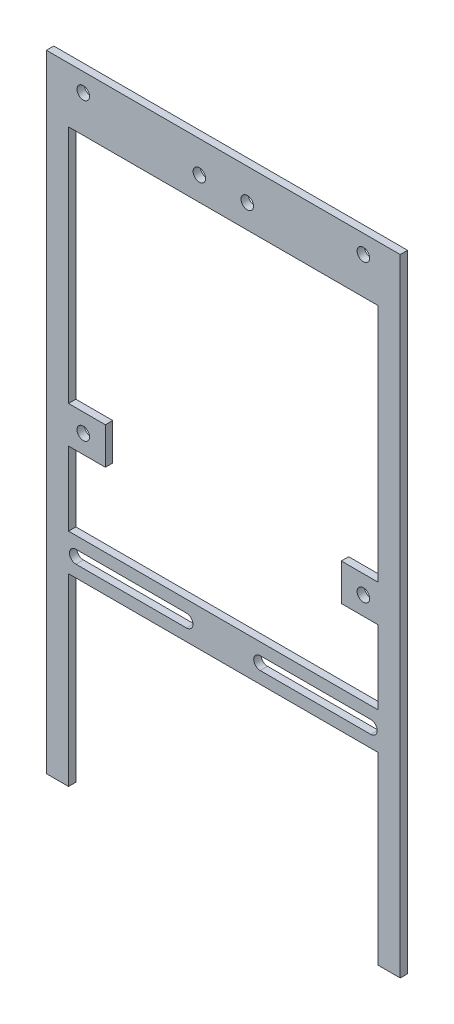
ISO-10303-21;
HEADER;
FILE_DESCRIPTION(('STEP AP214'),'2;1');
FILE_NAME('part.step','',(''),(''),'','','');
FILE_SCHEMA(('AUTOMOTIVE_DESIGN { 1 0 10303 214 1 1 1 1 }'));
ENDSEC;
DATA;
#1=APPLICATION_CONTEXT('core data for automotive mechanical design processes');
#2=APPLICATION_PROTOCOL_DEFINITION('international standard','automotive_design',2000,#1);
#3=PRODUCT_CONTEXT('',#1,'mechanical');
#4=PRODUCT('Part','Part','',(#3));
#5=PRODUCT_RELATED_PRODUCT_CATEGORY('part','',(#4));
#6=PRODUCT_DEFINITION_FORMATION('','',#4);
#7=PRODUCT_DEFINITION_CONTEXT('part definition',#1,'design');
#8=PRODUCT_DEFINITION('design','',#6,#7);
#9=PRODUCT_DEFINITION_SHAPE('','',#8);
#10=(LENGTH_UNIT() NAMED_UNIT(*) SI_UNIT(.MILLI.,.METRE.));
#11=(NAMED_UNIT(*) PLANE_ANGLE_UNIT() SI_UNIT($,.RADIAN.));
#12=(NAMED_UNIT(*) SI_UNIT($,.STERADIAN.) SOLID_ANGLE_UNIT());
#13=UNCERTAINTY_MEASURE_WITH_UNIT(LENGTH_MEASURE(1.E-05),#10,'distance_accuracy_value','');
#14=(GEOMETRIC_REPRESENTATION_CONTEXT(3) GLOBAL_UNCERTAINTY_ASSIGNED_CONTEXT((#13)) GLOBAL_UNIT_ASSIGNED_CONTEXT((#10,
#11,#12)) REPRESENTATION_CONTEXT('',''));
#15=CARTESIAN_POINT('',(0.,0.,0.));
#16=DIRECTION('',(0.,0.,1.));
#17=DIRECTION('',(1.,0.,0.));
#18=AXIS2_PLACEMENT_3D('',#15,#16,#17);
#19=CARTESIAN_POINT('',(0.,0.,2.));
#20=DIRECTION('',(0.,0.,1.));
#21=DIRECTION('',(1.,0.,0.));
#22=AXIS2_PLACEMENT_3D('',#19,#20,#21);
#23=PLANE('',#22);
#24=CARTESIAN_POINT('',(9.99999999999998,-30.,2.));
#25=DIRECTION('',(0.,0.,1.));
#26=DIRECTION('',(1.,0.,0.));
#27=AXIS2_PLACEMENT_3D('',#24,#25,#26);
#28=CIRCLE('',#27,1.75);
#29=CARTESIAN_POINT('',(9.99999999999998,-28.25,2.));
#30=VERTEX_POINT('',#29);
#31=CARTESIAN_POINT('',(9.99999999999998,-31.75,2.));
#32=VERTEX_POINT('',#31);
#33=EDGE_CURVE('E51',#30,#32,#28,.T.);
#34=ORIENTED_EDGE('',*,*,#33,.F.);
#35=DIRECTION('',(-1.,0.,0.));
#36=VECTOR('',#35,1.);
#37=CARTESIAN_POINT('',(9.99999999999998,-28.25,2.));
#38=LINE('',#37,#36);
#39=CARTESIAN_POINT('',(40.,-28.25,2.));
#40=VERTEX_POINT('',#39);
#41=EDGE_CURVE('E229',#40,#30,#38,.T.);
#42=ORIENTED_EDGE('',*,*,#41,.F.);
#43=CARTESIAN_POINT('',(40.,-30.,2.));
#44=DIRECTION('',(0.,0.,1.));
#45=DIRECTION('',(1.,0.,0.));
#46=AXIS2_PLACEMENT_3D('',#43,#44,#45);
#47=CIRCLE('',#46,1.75);
#48=CARTESIAN_POINT('',(40.,-31.75,2.));
#49=VERTEX_POINT('',#48);
#50=EDGE_CURVE('E249',#49,#40,#47,.T.);
#51=ORIENTED_EDGE('',*,*,#50,.F.);
#52=DIRECTION('',(1.,0.,0.));
#53=VECTOR('',#52,1.);
#54=CARTESIAN_POINT('',(9.99999999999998,-31.75,2.));
#55=LINE('',#54,#53);
#56=EDGE_CURVE('E243',#32,#49,#55,.T.);
#57=ORIENTED_EDGE('',*,*,#56,.F.);
#58=EDGE_LOOP('',(#34,#42,#51,#57));
#59=FACE_BOUND('',#58,.T.);
#60=CARTESIAN_POINT('',(-40.,-30.,2.));
#61=DIRECTION('',(0.,0.,1.));
#62=DIRECTION('',(1.,0.,0.));
#63=AXIS2_PLACEMENT_3D('',#60,#61,#62);
#64=CIRCLE('',#63,1.75);
#65=CARTESIAN_POINT('',(-40.,-28.25,2.));
#66=VERTEX_POINT('',#65);
#67=CARTESIAN_POINT('',(-40.,-31.75,2.));
#68=VERTEX_POINT('',#67);
#69=EDGE_CURVE('E265',#66,#68,#64,.T.);
#70=ORIENTED_EDGE('',*,*,#69,.F.);
#71=DIRECTION('',(-1.,0.,0.));
#72=VECTOR('',#71,1.);
#73=CARTESIAN_POINT('',(-40.,-28.25,2.));
#74=LINE('',#73,#72);
#75=CARTESIAN_POINT('',(-10.,-28.25,2.));
#76=VERTEX_POINT('',#75);
#77=EDGE_CURVE('E273',#76,#66,#74,.T.);
#78=ORIENTED_EDGE('',*,*,#77,.F.);
#79=CARTESIAN_POINT('',(-10.,-30.,2.));
#80=DIRECTION('',(0.,0.,1.));
#81=DIRECTION('',(1.,0.,0.));
#82=AXIS2_PLACEMENT_3D('',#79,#80,#81);
#83=CIRCLE('',#82,1.75);
#84=CARTESIAN_POINT('',(-10.,-31.75,2.));
#85=VERTEX_POINT('',#84);
#86=EDGE_CURVE('E270',#85,#76,#83,.T.);
#87=ORIENTED_EDGE('',*,*,#86,.F.);
#88=DIRECTION('',(1.,0.,0.));
#89=VECTOR('',#88,1.);
#90=CARTESIAN_POINT('',(-40.,-31.75,2.));
#91=LINE('',#90,#89);
#92=EDGE_CURVE('E267',#68,#85,#91,.T.);
#93=ORIENTED_EDGE('',*,*,#92,.F.);
#94=EDGE_LOOP('',(#70,#78,#87,#93));
#95=FACE_BOUND('',#94,.T.);
#96=CARTESIAN_POINT('',(-38.,79.9999999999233,2.));
#97=DIRECTION('',(0.,0.,1.));
#98=DIRECTION('',(1.,0.,0.));
#99=AXIS2_PLACEMENT_3D('',#96,#97,#98);
#100=CIRCLE('',#99,1.69999999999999);
#101=CARTESIAN_POINT('',(-36.3,79.9999999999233,2.));
#102=VERTEX_POINT('',#101);
#103=EDGE_CURVE('E429',#102,#102,#100,.T.);
#104=ORIENTED_EDGE('',*,*,#103,.F.);
#105=EDGE_LOOP('',(#104));
#106=FACE_BOUND('',#105,.T.);
#107=CARTESIAN_POINT('',(38.,79.9999999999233,2.));
#108=DIRECTION('',(0.,0.,1.));
#109=DIRECTION('',(1.,0.,0.));
#110=AXIS2_PLACEMENT_3D('',#107,#108,#109);
#111=CIRCLE('',#110,1.69999999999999);
#112=CARTESIAN_POINT('',(39.7,79.9999999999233,2.));
#113=VERTEX_POINT('',#112);
#114=EDGE_CURVE('E435',#113,#113,#111,.T.);
#115=ORIENTED_EDGE('',*,*,#114,.F.);
#116=EDGE_LOOP('',(#115));
#117=FACE_BOUND('',#116,.T.);
#118=CARTESIAN_POINT('',(-38.,-7.66695734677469E-11,2.));
#119=DIRECTION('',(0.,0.,1.));
#120=DIRECTION('',(1.,0.,0.));
#121=AXIS2_PLACEMENT_3D('',#118,#119,#120);
#122=CIRCLE('',#121,1.69999999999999);
#123=CARTESIAN_POINT('',(-36.3,-7.66695734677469E-11,2.));
#124=VERTEX_POINT('',#123);
#125=EDGE_CURVE('E441',#124,#124,#122,.T.);
#126=ORIENTED_EDGE('',*,*,#125,.F.);
#127=EDGE_LOOP('',(#126));
#128=FACE_BOUND('',#127,.T.);
#129=CARTESIAN_POINT('',(38.,-7.66461547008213E-11,2.));
#130=DIRECTION('',(0.,0.,1.));
#131=DIRECTION('',(1.,0.,0.));
#132=AXIS2_PLACEMENT_3D('',#129,#130,#131);
#133=CIRCLE('',#132,1.69999999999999);
#134=CARTESIAN_POINT('',(39.7,-7.66461547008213E-11,2.));
#135=VERTEX_POINT('',#134);
#136=EDGE_CURVE('E447',#135,#135,#133,.T.);
#137=ORIENTED_EDGE('',*,*,#136,.F.);
#138=EDGE_LOOP('',(#137));
#139=FACE_BOUND('',#138,.T.);
#140=CARTESIAN_POINT('',(-6.50000000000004,76.4436386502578,2.));
#141=DIRECTION('',(0.,0.,1.));
#142=DIRECTION('',(1.,0.,0.));
#143=AXIS2_PLACEMENT_3D('',#140,#141,#142);
#144=CIRCLE('',#143,1.69999999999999);
#145=CARTESIAN_POINT('',(-4.80000000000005,76.4436386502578,2.));
#146=VERTEX_POINT('',#145);
#147=EDGE_CURVE('E453',#146,#146,#144,.T.);
#148=ORIENTED_EDGE('',*,*,#147,.F.);
#149=EDGE_LOOP('',(#148));
#150=FACE_BOUND('',#149,.T.);
#151=CARTESIAN_POINT('',(6.49999999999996,76.4436386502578,2.));
#152=DIRECTION('',(0.,0.,1.));
#153=DIRECTION('',(1.,0.,0.));
#154=AXIS2_PLACEMENT_3D('',#151,#152,#153);
#155=CIRCLE('',#154,1.69999999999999);
#156=CARTESIAN_POINT('',(8.19999999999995,76.4436386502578,2.));
#157=VERTEX_POINT('',#156);
#158=EDGE_CURVE('E459',#157,#157,#155,.T.);
#159=ORIENTED_EDGE('',*,*,#158,.F.);
#160=EDGE_LOOP('',(#159));
#161=FACE_BOUND('',#160,.T.);
#162=DIRECTION('',(0.,-1.,0.));
#163=VECTOR('',#162,1.);
#164=CARTESIAN_POINT('',(32.,0.,2.));
#165=LINE('',#164,#163);
#166=CARTESIAN_POINT('',(32.,4.99999999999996,2.));
#167=VERTEX_POINT('',#166);
#168=CARTESIAN_POINT('',(32.,-5.00000000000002,2.));
#169=VERTEX_POINT('',#168);
#170=EDGE_CURVE('E368',#167,#169,#165,.T.);
#171=ORIENTED_EDGE('',*,*,#170,.T.);
#172=DIRECTION('',(1.,0.,0.));
#173=VECTOR('',#172,1.);
#174=CARTESIAN_POINT('',(0.,-4.99999999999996,2.));
#175=LINE('',#174,#173);
#176=CARTESIAN_POINT('',(42.,-5.00000000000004,2.));
#177=VERTEX_POINT('',#176);
#178=EDGE_CURVE('E365',#169,#177,#175,.T.);
#179=ORIENTED_EDGE('',*,*,#178,.T.);
#180=DIRECTION('',(0.,-1.,0.));
#181=VECTOR('',#180,1.);
#182=CARTESIAN_POINT('',(42.,0.,2.));
#183=LINE('',#182,#181);
#184=CARTESIAN_POINT('',(42.,-25.,2.));
#185=VERTEX_POINT('',#184);
#186=EDGE_CURVE('E398',#177,#185,#183,.T.);
#187=ORIENTED_EDGE('',*,*,#186,.T.);
#188=DIRECTION('',(1.,0.,0.));
#189=VECTOR('',#188,1.);
#190=CARTESIAN_POINT('',(0.,-25.,2.));
#191=LINE('',#190,#189);
#192=CARTESIAN_POINT('',(-42.,-25.,2.));
#193=VERTEX_POINT('',#192);
#194=EDGE_CURVE('E395',#193,#185,#191,.T.);
#195=ORIENTED_EDGE('',*,*,#194,.F.);
#196=DIRECTION('',(0.,-1.,0.));
#197=VECTOR('',#196,1.);
#198=CARTESIAN_POINT('',(-42.,0.,2.));
#199=LINE('',#198,#197);
#200=CARTESIAN_POINT('',(-42.,-5.00000000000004,2.));
#201=VERTEX_POINT('',#200);
#202=EDGE_CURVE('E392',#201,#193,#199,.T.);
#203=ORIENTED_EDGE('',*,*,#202,.F.);
#204=DIRECTION('',(1.,0.,0.));
#205=VECTOR('',#204,1.);
#206=CARTESIAN_POINT('',(0.,-4.99999999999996,2.));
#207=LINE('',#206,#205);
#208=CARTESIAN_POINT('',(-32.,-5.00000000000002,2.));
#209=VERTEX_POINT('',#208);
#210=EDGE_CURVE('E389',#201,#209,#207,.T.);
#211=ORIENTED_EDGE('',*,*,#210,.T.);
#212=DIRECTION('',(0.,-1.,0.));
#213=VECTOR('',#212,1.);
#214=CARTESIAN_POINT('',(-32.,0.,2.));
#215=LINE('',#214,#213);
#216=CARTESIAN_POINT('',(-32.,4.99999999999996,2.));
#217=VERTEX_POINT('',#216);
#218=EDGE_CURVE('E386',#217,#209,#215,.T.);
#219=ORIENTED_EDGE('',*,*,#218,.F.);
#220=DIRECTION('',(1.,0.,0.));
#221=VECTOR('',#220,1.);
#222=CARTESIAN_POINT('',(0.,4.99999999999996,2.));
#223=LINE('',#222,#221);
#224=CARTESIAN_POINT('',(-42.,4.99999999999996,2.));
#225=VERTEX_POINT('',#224);
#226=EDGE_CURVE('E383',#225,#217,#223,.T.);
#227=ORIENTED_EDGE('',*,*,#226,.F.);
#228=DIRECTION('',(0.,-1.,0.));
#229=VECTOR('',#228,1.);
#230=CARTESIAN_POINT('',(-42.,0.,2.));
#231=LINE('',#230,#229);
#232=CARTESIAN_POINT('',(-42.,70.,2.));
#233=VERTEX_POINT('',#232);
#234=EDGE_CURVE('E380',#233,#225,#231,.T.);
#235=ORIENTED_EDGE('',*,*,#234,.F.);
#236=DIRECTION('',(1.,0.,0.));
#237=VECTOR('',#236,1.);
#238=CARTESIAN_POINT('',(0.,70.,2.));
#239=LINE('',#238,#237);
#240=CARTESIAN_POINT('',(42.,70.,2.));
#241=VERTEX_POINT('',#240);
#242=EDGE_CURVE('E377',#233,#241,#239,.T.);
#243=ORIENTED_EDGE('',*,*,#242,.T.);
#244=DIRECTION('',(0.,-1.,0.));
#245=VECTOR('',#244,1.);
#246=CARTESIAN_POINT('',(42.,0.,2.));
#247=LINE('',#246,#245);
#248=CARTESIAN_POINT('',(42.,4.99999999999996,2.));
#249=VERTEX_POINT('',#248);
#250=EDGE_CURVE('E374',#241,#249,#247,.T.);
#251=ORIENTED_EDGE('',*,*,#250,.T.);
#252=DIRECTION('',(1.,0.,0.));
#253=VECTOR('',#252,1.);
#254=CARTESIAN_POINT('',(0.,4.99999999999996,2.));
#255=LINE('',#254,#253);
#256=EDGE_CURVE('E371',#167,#249,#255,.T.);
#257=ORIENTED_EDGE('',*,*,#256,.F.);
#258=EDGE_LOOP('',(#171,#179,#187,#195,#203,#211,#219,#227,#235,#243,#251,#257));
#259=FACE_BOUND('',#258,.T.);
#260=DIRECTION('',(1.,0.,0.));
#261=VECTOR('',#260,1.);
#262=CARTESIAN_POINT('',(0.,-35.,2.));
#263=LINE('',#262,#261);
#264=CARTESIAN_POINT('',(-42.,-35.,2.));
#265=VERTEX_POINT('',#264);
#266=CARTESIAN_POINT('',(42.,-35.,2.));
#267=VERTEX_POINT('',#266);
#268=EDGE_CURVE('E320',#265,#267,#263,.T.);
#269=ORIENTED_EDGE('',*,*,#268,.T.);
#270=DIRECTION('',(0.,-1.,0.));
#271=VECTOR('',#270,1.);
#272=CARTESIAN_POINT('',(42.,0.,2.));
#273=LINE('',#272,#271);
#274=CARTESIAN_POINT('',(42.,-85.,2.));
#275=VERTEX_POINT('',#274);
#276=EDGE_CURVE('E317',#267,#275,#273,.T.);
#277=ORIENTED_EDGE('',*,*,#276,.T.);
#278=DIRECTION('',(1.,0.,0.));
#279=VECTOR('',#278,1.);
#280=CARTESIAN_POINT('',(-47.,-85.,2.));
#281=LINE('',#280,#279);
#282=CARTESIAN_POINT('',(48.,-85.,2.));
#283=VERTEX_POINT('',#282);
#284=EDGE_CURVE('E43',#275,#283,#281,.T.);
#285=ORIENTED_EDGE('',*,*,#284,.T.);
#286=DIRECTION('',(0.,-1.,0.));
#287=VECTOR('',#286,1.);
#288=CARTESIAN_POINT('',(48.,85.,2.));
#289=LINE('',#288,#287);
#290=CARTESIAN_POINT('',(48.,85.,2.));
#291=VERTEX_POINT('',#290);
#292=EDGE_CURVE('E309',#291,#283,#289,.T.);
#293=ORIENTED_EDGE('',*,*,#292,.F.);
#294=DIRECTION('',(-1.,0.,0.));
#295=VECTOR('',#294,1.);
#296=CARTESIAN_POINT('',(-47.,85.,2.));
#297=LINE('',#296,#295);
#298=CARTESIAN_POINT('',(-48.,85.,2.));
#299=VERTEX_POINT('',#298);
#300=EDGE_CURVE('E466',#291,#299,#297,.T.);
#301=ORIENTED_EDGE('',*,*,#300,.T.);
#302=DIRECTION('',(0.,1.,0.));
#303=VECTOR('',#302,1.);
#304=CARTESIAN_POINT('',(-48.,-85.,2.));
#305=LINE('',#304,#303);
#306=CARTESIAN_POINT('',(-48.,-85.,2.));
#307=VERTEX_POINT('',#306);
#308=EDGE_CURVE('E297',#307,#299,#305,.T.);
#309=ORIENTED_EDGE('',*,*,#308,.F.);
#310=CARTESIAN_POINT('',(-42.,-85.,2.));
#311=VERTEX_POINT('',#310);
#312=EDGE_CURVE('E11',#307,#311,#281,.T.);
#313=ORIENTED_EDGE('',*,*,#312,.T.);
#314=DIRECTION('',(0.,-1.,0.));
#315=VECTOR('',#314,1.);
#316=CARTESIAN_POINT('',(-42.,0.,2.));
#317=LINE('',#316,#315);
#318=EDGE_CURVE('E323',#265,#311,#317,.T.);
#319=ORIENTED_EDGE('',*,*,#318,.F.);
#320=EDGE_LOOP('',(#269,#277,#285,#293,#301,#309,#313,#319));
#321=FACE_BOUND('',#320,.T.);
#322=ADVANCED_FACE('F34',(#59,#95,#106,#117,#128,#139,#150,#161,#259,#321),#23,.T.);
#323=CARTESIAN_POINT('',(0.,0.,0.));
#324=DIRECTION('',(0.,0.,1.));
#325=DIRECTION('',(1.,0.,0.));
#326=AXIS2_PLACEMENT_3D('',#323,#324,#325);
#327=PLANE('',#326);
#328=DIRECTION('',(1.,0.,0.));
#329=VECTOR('',#328,1.);
#330=CARTESIAN_POINT('',(9.99999999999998,-28.25,0.));
#331=LINE('',#330,#329);
#332=CARTESIAN_POINT('',(9.99999999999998,-28.25,0.));
#333=VERTEX_POINT('',#332);
#334=CARTESIAN_POINT('',(40.,-28.25,0.));
#335=VERTEX_POINT('',#334);
#336=EDGE_CURVE('E241',#333,#335,#331,.T.);
#337=ORIENTED_EDGE('',*,*,#336,.F.);
#338=CARTESIAN_POINT('',(9.99999999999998,-30.,0.));
#339=DIRECTION('',(0.,0.,1.));
#340=DIRECTION('',(1.,0.,0.));
#341=AXIS2_PLACEMENT_3D('',#338,#339,#340);
#342=CIRCLE('',#341,1.75);
#343=CARTESIAN_POINT('',(9.99999999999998,-31.75,0.));
#344=VERTEX_POINT('',#343);
#345=EDGE_CURVE('E223',#344,#333,#342,.F.);
#346=ORIENTED_EDGE('',*,*,#345,.F.);
#347=DIRECTION('',(-1.,0.,0.));
#348=VECTOR('',#347,1.);
#349=CARTESIAN_POINT('',(9.99999999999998,-31.75,0.));
#350=LINE('',#349,#348);
#351=CARTESIAN_POINT('',(40.,-31.75,0.));
#352=VERTEX_POINT('',#351);
#353=EDGE_CURVE('E232',#352,#344,#350,.T.);
#354=ORIENTED_EDGE('',*,*,#353,.F.);
#355=CARTESIAN_POINT('',(40.,-30.,0.));
#356=DIRECTION('',(0.,0.,1.));
#357=DIRECTION('',(1.,0.,0.));
#358=AXIS2_PLACEMENT_3D('',#355,#356,#357);
#359=CIRCLE('',#358,1.75);
#360=EDGE_CURVE('E59',#335,#352,#359,.F.);
#361=ORIENTED_EDGE('',*,*,#360,.F.);
#362=EDGE_LOOP('',(#337,#346,#354,#361));
#363=FACE_BOUND('',#362,.T.);
#364=DIRECTION('',(1.,0.,0.));
#365=VECTOR('',#364,1.);
#366=CARTESIAN_POINT('',(-40.,-28.25,0.));
#367=LINE('',#366,#365);
#368=CARTESIAN_POINT('',(-40.,-28.25,0.));
#369=VERTEX_POINT('',#368);
#370=CARTESIAN_POINT('',(-10.,-28.25,0.));
#371=VERTEX_POINT('',#370);
#372=EDGE_CURVE('E259',#369,#371,#367,.T.);
#373=ORIENTED_EDGE('',*,*,#372,.F.);
#374=CARTESIAN_POINT('',(-40.,-30.,0.));
#375=DIRECTION('',(0.,0.,1.));
#376=DIRECTION('',(1.,0.,0.));
#377=AXIS2_PLACEMENT_3D('',#374,#375,#376);
#378=CIRCLE('',#377,1.75);
#379=CARTESIAN_POINT('',(-40.,-31.75,0.));
#380=VERTEX_POINT('',#379);
#381=EDGE_CURVE('E262',#380,#369,#378,.F.);
#382=ORIENTED_EDGE('',*,*,#381,.F.);
#383=DIRECTION('',(-1.,0.,0.));
#384=VECTOR('',#383,1.);
#385=CARTESIAN_POINT('',(-40.,-31.75,0.));
#386=LINE('',#385,#384);
#387=CARTESIAN_POINT('',(-10.,-31.75,0.));
#388=VERTEX_POINT('',#387);
#389=EDGE_CURVE('E279',#388,#380,#386,.T.);
#390=ORIENTED_EDGE('',*,*,#389,.F.);
#391=CARTESIAN_POINT('',(-10.,-30.,0.));
#392=DIRECTION('',(0.,0.,1.));
#393=DIRECTION('',(1.,0.,0.));
#394=AXIS2_PLACEMENT_3D('',#391,#392,#393);
#395=CIRCLE('',#394,1.75);
#396=EDGE_CURVE('E235',#371,#388,#395,.F.);
#397=ORIENTED_EDGE('',*,*,#396,.F.);
#398=EDGE_LOOP('',(#373,#382,#390,#397));
#399=FACE_BOUND('',#398,.T.);
#400=DIRECTION('',(-1.,0.,0.));
#401=VECTOR('',#400,1.);
#402=CARTESIAN_POINT('',(0.,-4.99999999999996,0.));
#403=LINE('',#402,#401);
#404=CARTESIAN_POINT('',(42.,-5.00000000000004,0.));
#405=VERTEX_POINT('',#404);
#406=CARTESIAN_POINT('',(32.,-5.00000000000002,0.));
#407=VERTEX_POINT('',#406);
#408=EDGE_CURVE('E362',#405,#407,#403,.T.);
#409=ORIENTED_EDGE('',*,*,#408,.T.);
#410=DIRECTION('',(0.,1.,0.));
#411=VECTOR('',#410,1.);
#412=CARTESIAN_POINT('',(32.,0.,0.));
#413=LINE('',#412,#411);
#414=CARTESIAN_POINT('',(32.,4.99999999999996,0.));
#415=VERTEX_POINT('',#414);
#416=EDGE_CURVE('E404',#407,#415,#413,.T.);
#417=ORIENTED_EDGE('',*,*,#416,.T.);
#418=DIRECTION('',(-1.,0.,0.));
#419=VECTOR('',#418,1.);
#420=CARTESIAN_POINT('',(0.,4.99999999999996,0.));
#421=LINE('',#420,#419);
#422=CARTESIAN_POINT('',(42.,4.99999999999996,0.));
#423=VERTEX_POINT('',#422);
#424=EDGE_CURVE('E337',#423,#415,#421,.T.);
#425=ORIENTED_EDGE('',*,*,#424,.F.);
#426=DIRECTION('',(0.,1.,0.));
#427=VECTOR('',#426,1.);
#428=CARTESIAN_POINT('',(42.,0.,0.));
#429=LINE('',#428,#427);
#430=CARTESIAN_POINT('',(42.,70.,0.));
#431=VERTEX_POINT('',#430);
#432=EDGE_CURVE('E340',#423,#431,#429,.T.);
#433=ORIENTED_EDGE('',*,*,#432,.T.);
#434=DIRECTION('',(-1.,0.,0.));
#435=VECTOR('',#434,1.);
#436=CARTESIAN_POINT('',(0.,70.,0.));
#437=LINE('',#436,#435);
#438=CARTESIAN_POINT('',(-42.,70.,0.));
#439=VERTEX_POINT('',#438);
#440=EDGE_CURVE('E343',#431,#439,#437,.T.);
#441=ORIENTED_EDGE('',*,*,#440,.T.);
#442=DIRECTION('',(0.,1.,0.));
#443=VECTOR('',#442,1.);
#444=CARTESIAN_POINT('',(-42.,0.,0.));
#445=LINE('',#444,#443);
#446=CARTESIAN_POINT('',(-42.,4.99999999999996,0.));
#447=VERTEX_POINT('',#446);
#448=EDGE_CURVE('E346',#447,#439,#445,.T.);
#449=ORIENTED_EDGE('',*,*,#448,.F.);
#450=DIRECTION('',(-1.,0.,0.));
#451=VECTOR('',#450,1.);
#452=CARTESIAN_POINT('',(0.,4.99999999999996,0.));
#453=LINE('',#452,#451);
#454=CARTESIAN_POINT('',(-32.,4.99999999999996,0.));
#455=VERTEX_POINT('',#454);
#456=EDGE_CURVE('E348',#455,#447,#453,.T.);
#457=ORIENTED_EDGE('',*,*,#456,.F.);
#458=DIRECTION('',(0.,1.,0.));
#459=VECTOR('',#458,1.);
#460=CARTESIAN_POINT('',(-32.,0.,0.));
#461=LINE('',#460,#459);
#462=CARTESIAN_POINT('',(-32.,-5.00000000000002,0.));
#463=VERTEX_POINT('',#462);
#464=EDGE_CURVE('E350',#463,#455,#461,.T.);
#465=ORIENTED_EDGE('',*,*,#464,.F.);
#466=DIRECTION('',(-1.,0.,0.));
#467=VECTOR('',#466,1.);
#468=CARTESIAN_POINT('',(0.,-4.99999999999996,0.));
#469=LINE('',#468,#467);
#470=CARTESIAN_POINT('',(-42.,-5.00000000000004,0.));
#471=VERTEX_POINT('',#470);
#472=EDGE_CURVE('E352',#463,#471,#469,.T.);
#473=ORIENTED_EDGE('',*,*,#472,.T.);
#474=DIRECTION('',(0.,1.,0.));
#475=VECTOR('',#474,1.);
#476=CARTESIAN_POINT('',(-42.,0.,0.));
#477=LINE('',#476,#475);
#478=CARTESIAN_POINT('',(-42.,-25.,0.));
#479=VERTEX_POINT('',#478);
#480=EDGE_CURVE('E355',#479,#471,#477,.T.);
#481=ORIENTED_EDGE('',*,*,#480,.F.);
#482=DIRECTION('',(-1.,0.,0.));
#483=VECTOR('',#482,1.);
#484=CARTESIAN_POINT('',(0.,-25.,0.));
#485=LINE('',#484,#483);
#486=CARTESIAN_POINT('',(42.,-25.,0.));
#487=VERTEX_POINT('',#486);
#488=EDGE_CURVE('E357',#487,#479,#485,.T.);
#489=ORIENTED_EDGE('',*,*,#488,.F.);
#490=DIRECTION('',(0.,1.,0.));
#491=VECTOR('',#490,1.);
#492=CARTESIAN_POINT('',(42.,0.,0.));
#493=LINE('',#492,#491);
#494=EDGE_CURVE('E359',#487,#405,#493,.T.);
#495=ORIENTED_EDGE('',*,*,#494,.T.);
#496=EDGE_LOOP('',(#409,#417,#425,#433,#441,#449,#457,#465,#473,#481,#489,#495));
#497=FACE_BOUND('',#496,.T.);
#498=CARTESIAN_POINT('',(-38.,79.9999999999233,0.));
#499=DIRECTION('',(0.,0.,1.));
#500=DIRECTION('',(1.,0.,0.));
#501=AXIS2_PLACEMENT_3D('',#498,#499,#500);
#502=CIRCLE('',#501,1.7);
#503=CARTESIAN_POINT('',(-36.3,79.9999999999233,0.));
#504=VERTEX_POINT('',#503);
#505=EDGE_CURVE('E432',#504,#504,#502,.T.);
#506=ORIENTED_EDGE('',*,*,#505,.T.);
#507=EDGE_LOOP('',(#506));
#508=FACE_BOUND('',#507,.T.);
#509=CARTESIAN_POINT('',(38.,79.9999999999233,0.));
#510=DIRECTION('',(0.,0.,1.));
#511=DIRECTION('',(1.,0.,0.));
#512=AXIS2_PLACEMENT_3D('',#509,#510,#511);
#513=CIRCLE('',#512,1.7);
#514=CARTESIAN_POINT('',(39.7,79.9999999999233,0.));
#515=VERTEX_POINT('',#514);
#516=EDGE_CURVE('E438',#515,#515,#513,.T.);
#517=ORIENTED_EDGE('',*,*,#516,.T.);
#518=EDGE_LOOP('',(#517));
#519=FACE_BOUND('',#518,.T.);
#520=CARTESIAN_POINT('',(-38.,-7.66695734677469E-11,0.));
#521=DIRECTION('',(0.,0.,1.));
#522=DIRECTION('',(1.,0.,0.));
#523=AXIS2_PLACEMENT_3D('',#520,#521,#522);
#524=CIRCLE('',#523,1.7);
#525=CARTESIAN_POINT('',(-36.3,-7.66695734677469E-11,0.));
#526=VERTEX_POINT('',#525);
#527=EDGE_CURVE('E444',#526,#526,#524,.T.);
#528=ORIENTED_EDGE('',*,*,#527,.T.);
#529=EDGE_LOOP('',(#528));
#530=FACE_BOUND('',#529,.T.);
#531=CARTESIAN_POINT('',(38.,-7.66461547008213E-11,0.));
#532=DIRECTION('',(0.,0.,1.));
#533=DIRECTION('',(1.,0.,0.));
#534=AXIS2_PLACEMENT_3D('',#531,#532,#533);
#535=CIRCLE('',#534,1.7);
#536=CARTESIAN_POINT('',(39.7,-7.66461547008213E-11,0.));
#537=VERTEX_POINT('',#536);
#538=EDGE_CURVE('E450',#537,#537,#535,.T.);
#539=ORIENTED_EDGE('',*,*,#538,.T.);
#540=EDGE_LOOP('',(#539));
#541=FACE_BOUND('',#540,.T.);
#542=CARTESIAN_POINT('',(-6.50000000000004,76.4436386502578,0.));
#543=DIRECTION('',(0.,0.,1.));
#544=DIRECTION('',(1.,0.,0.));
#545=AXIS2_PLACEMENT_3D('',#542,#543,#544);
#546=CIRCLE('',#545,1.7);
#547=CARTESIAN_POINT('',(-4.80000000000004,76.4436386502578,0.));
#548=VERTEX_POINT('',#547);
#549=EDGE_CURVE('E456',#548,#548,#546,.T.);
#550=ORIENTED_EDGE('',*,*,#549,.T.);
#551=EDGE_LOOP('',(#550));
#552=FACE_BOUND('',#551,.T.);
#553=CARTESIAN_POINT('',(6.49999999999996,76.4436386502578,0.));
#554=DIRECTION('',(0.,0.,1.));
#555=DIRECTION('',(1.,0.,0.));
#556=AXIS2_PLACEMENT_3D('',#553,#554,#555);
#557=CIRCLE('',#556,1.7);
#558=CARTESIAN_POINT('',(8.19999999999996,76.4436386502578,0.));
#559=VERTEX_POINT('',#558);
#560=EDGE_CURVE('E462',#559,#559,#557,.T.);
#561=ORIENTED_EDGE('',*,*,#560,.T.);
#562=EDGE_LOOP('',(#561));
#563=FACE_BOUND('',#562,.T.);
#564=DIRECTION('',(0.,1.,0.));
#565=VECTOR('',#564,1.);
#566=CARTESIAN_POINT('',(42.,0.,0.));
#567=LINE('',#566,#565);
#568=CARTESIAN_POINT('',(42.,-85.,0.));
#569=VERTEX_POINT('',#568);
#570=CARTESIAN_POINT('',(42.,-35.,0.));
#571=VERTEX_POINT('',#570);
#572=EDGE_CURVE('E314',#569,#571,#567,.T.);
#573=ORIENTED_EDGE('',*,*,#572,.T.);
#574=DIRECTION('',(-1.,0.,0.));
#575=VECTOR('',#574,1.);
#576=CARTESIAN_POINT('',(0.,-35.,0.));
#577=LINE('',#576,#575);
#578=CARTESIAN_POINT('',(-42.,-35.,0.));
#579=VERTEX_POINT('',#578);
#580=EDGE_CURVE('E328',#571,#579,#577,.T.);
#581=ORIENTED_EDGE('',*,*,#580,.T.);
#582=DIRECTION('',(0.,1.,0.));
#583=VECTOR('',#582,1.);
#584=CARTESIAN_POINT('',(-42.,0.,0.));
#585=LINE('',#584,#583);
#586=CARTESIAN_POINT('',(-42.,-85.,0.));
#587=VERTEX_POINT('',#586);
#588=EDGE_CURVE('E312',#587,#579,#585,.T.);
#589=ORIENTED_EDGE('',*,*,#588,.F.);
#590=DIRECTION('',(1.,0.,0.));
#591=VECTOR('',#590,1.);
#592=CARTESIAN_POINT('',(-47.,-85.,0.));
#593=LINE('',#592,#591);
#594=CARTESIAN_POINT('',(-48.,-85.,0.));
#595=VERTEX_POINT('',#594);
#596=EDGE_CURVE('E38',#595,#587,#593,.T.);
#597=ORIENTED_EDGE('',*,*,#596,.F.);
#598=DIRECTION('',(0.,-1.,0.));
#599=VECTOR('',#598,1.);
#600=CARTESIAN_POINT('',(-48.,85.,0.));
#601=LINE('',#600,#599);
#602=CARTESIAN_POINT('',(-48.,85.,0.));
#603=VERTEX_POINT('',#602);
#604=EDGE_CURVE('E291',#603,#595,#601,.T.);
#605=ORIENTED_EDGE('',*,*,#604,.F.);
#606=DIRECTION('',(-1.,0.,0.));
#607=VECTOR('',#606,1.);
#608=CARTESIAN_POINT('',(-47.,85.,0.));
#609=LINE('',#608,#607);
#610=CARTESIAN_POINT('',(48.,85.,0.));
#611=VERTEX_POINT('',#610);
#612=EDGE_CURVE('E465',#611,#603,#609,.T.);
#613=ORIENTED_EDGE('',*,*,#612,.F.);
#614=DIRECTION('',(0.,1.,0.));
#615=VECTOR('',#614,1.);
#616=CARTESIAN_POINT('',(48.,-85.,0.));
#617=LINE('',#616,#615);
#618=CARTESIAN_POINT('',(48.,-85.,0.));
#619=VERTEX_POINT('',#618);
#620=EDGE_CURVE('E303',#619,#611,#617,.T.);
#621=ORIENTED_EDGE('',*,*,#620,.F.);
#622=EDGE_CURVE('E467',#569,#619,#593,.T.);
#623=ORIENTED_EDGE('',*,*,#622,.F.);
#624=EDGE_LOOP('',(#573,#581,#589,#597,#605,#613,#621,#623));
#625=FACE_BOUND('',#624,.T.);
#626=ADVANCED_FACE('F238',(#363,#399,#497,#508,#519,#530,#541,#552,#563,#625),#327,.F.);
#627=CARTESIAN_POINT('',(-47.,-85.,2.));
#628=DIRECTION('',(0.,1.,0.));
#629=DIRECTION('',(0.,0.,1.));
#630=AXIS2_PLACEMENT_3D('',#627,#628,#629);
#631=PLANE('',#630);
#632=DIRECTION('',(0.,0.,1.));
#633=VECTOR('',#632,1.);
#634=CARTESIAN_POINT('',(42.,-85.,-0.00100000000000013));
#635=LINE('',#634,#633);
#636=EDGE_CURVE('E326',#569,#275,#635,.T.);
#637=ORIENTED_EDGE('',*,*,#636,.F.);
#638=ORIENTED_EDGE('',*,*,#622,.T.);
#639=DIRECTION('',(0.,0.,-1.));
#640=VECTOR('',#639,1.);
#641=CARTESIAN_POINT('',(48.,-85.,2.));
#642=LINE('',#641,#640);
#643=EDGE_CURVE('E300',#283,#619,#642,.T.);
#644=ORIENTED_EDGE('',*,*,#643,.F.);
#645=ORIENTED_EDGE('',*,*,#284,.F.);
#646=EDGE_LOOP('',(#637,#638,#644,#645));
#647=FACE_BOUND('',#646,.T.);
#648=ADVANCED_FACE('F492',(#647),#631,.F.);
#649=CARTESIAN_POINT('',(-47.,85.,2.));
#650=DIRECTION('',(0.,-1.,0.));
#651=DIRECTION('',(0.,0.,-1.));
#652=AXIS2_PLACEMENT_3D('',#649,#650,#651);
#653=PLANE('',#652);
#654=ORIENTED_EDGE('',*,*,#612,.T.);
#655=DIRECTION('',(0.,0.,-1.));
#656=VECTOR('',#655,1.);
#657=CARTESIAN_POINT('',(-48.,85.,2.));
#658=LINE('',#657,#656);
#659=EDGE_CURVE('E288',#299,#603,#658,.T.);
#660=ORIENTED_EDGE('',*,*,#659,.F.);
#661=ORIENTED_EDGE('',*,*,#300,.F.);
#662=DIRECTION('',(0.,0.,1.));
#663=VECTOR('',#662,1.);
#664=CARTESIAN_POINT('',(48.,85.,0.));
#665=LINE('',#664,#663);
#666=EDGE_CURVE('E306',#611,#291,#665,.T.);
#667=ORIENTED_EDGE('',*,*,#666,.F.);
#668=EDGE_LOOP('',(#654,#660,#661,#667));
#669=FACE_BOUND('',#668,.T.);
#670=ADVANCED_FACE('F36',(#669),#653,.F.);
#671=ORIENTED_EDGE('',*,*,#596,.T.);
#672=DIRECTION('',(0.,0.,1.));
#673=VECTOR('',#672,1.);
#674=CARTESIAN_POINT('',(-42.,-85.,-0.00100000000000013));
#675=LINE('',#674,#673);
#676=EDGE_CURVE('E329',#587,#311,#675,.T.);
#677=ORIENTED_EDGE('',*,*,#676,.T.);
#678=ORIENTED_EDGE('',*,*,#312,.F.);
#679=DIRECTION('',(0.,0.,1.));
#680=VECTOR('',#679,1.);
#681=CARTESIAN_POINT('',(-48.,-85.,0.));
#682=LINE('',#681,#680);
#683=EDGE_CURVE('E294',#595,#307,#682,.T.);
#684=ORIENTED_EDGE('',*,*,#683,.F.);
#685=EDGE_LOOP('',(#671,#677,#678,#684));
#686=FACE_BOUND('',#685,.T.);
#687=ADVANCED_FACE('F480',(#686),#631,.F.);
#688=CARTESIAN_POINT('',(6.49999999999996,76.4436386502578,2.));
#689=DIRECTION('',(0.,0.,1.));
#690=DIRECTION('',(1.,0.,0.));
#691=AXIS2_PLACEMENT_3D('',#688,#689,#690);
#692=CYLINDRICAL_SURFACE('',#691,1.69999999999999);
#693=ORIENTED_EDGE('',*,*,#560,.F.);
#694=EDGE_LOOP('',(#693));
#695=FACE_BOUND('',#694,.T.);
#696=ORIENTED_EDGE('',*,*,#158,.T.);
#697=EDGE_LOOP('',(#696));
#698=FACE_BOUND('',#697,.T.);
#699=ADVANCED_FACE('F522',(#695,#698),#692,.F.);
#700=CARTESIAN_POINT('',(-6.50000000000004,76.4436386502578,2.));
#701=DIRECTION('',(0.,0.,1.));
#702=DIRECTION('',(1.,0.,0.));
#703=AXIS2_PLACEMENT_3D('',#700,#701,#702);
#704=CYLINDRICAL_SURFACE('',#703,1.69999999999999);
#705=ORIENTED_EDGE('',*,*,#549,.F.);
#706=EDGE_LOOP('',(#705));
#707=FACE_BOUND('',#706,.T.);
#708=ORIENTED_EDGE('',*,*,#147,.T.);
#709=EDGE_LOOP('',(#708));
#710=FACE_BOUND('',#709,.T.);
#711=ADVANCED_FACE('F529',(#707,#710),#704,.F.);
#712=CARTESIAN_POINT('',(38.,-7.66461547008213E-11,2.));
#713=DIRECTION('',(0.,0.,1.));
#714=DIRECTION('',(1.,0.,0.));
#715=AXIS2_PLACEMENT_3D('',#712,#713,#714);
#716=CYLINDRICAL_SURFACE('',#715,1.69999999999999);
#717=ORIENTED_EDGE('',*,*,#538,.F.);
#718=EDGE_LOOP('',(#717));
#719=FACE_BOUND('',#718,.T.);
#720=ORIENTED_EDGE('',*,*,#136,.T.);
#721=EDGE_LOOP('',(#720));
#722=FACE_BOUND('',#721,.T.);
#723=ADVANCED_FACE('F813',(#719,#722),#716,.F.);
#724=CARTESIAN_POINT('',(-38.,-7.66695734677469E-11,2.));
#725=DIRECTION('',(0.,0.,1.));
#726=DIRECTION('',(1.,0.,0.));
#727=AXIS2_PLACEMENT_3D('',#724,#725,#726);
#728=CYLINDRICAL_SURFACE('',#727,1.69999999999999);
#729=ORIENTED_EDGE('',*,*,#527,.F.);
#730=EDGE_LOOP('',(#729));
#731=FACE_BOUND('',#730,.T.);
#732=ORIENTED_EDGE('',*,*,#125,.T.);
#733=EDGE_LOOP('',(#732));
#734=FACE_BOUND('',#733,.T.);
#735=ADVANCED_FACE('F803',(#731,#734),#728,.F.);
#736=CARTESIAN_POINT('',(38.,79.9999999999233,2.));
#737=DIRECTION('',(0.,0.,1.));
#738=DIRECTION('',(1.,0.,0.));
#739=AXIS2_PLACEMENT_3D('',#736,#737,#738);
#740=CYLINDRICAL_SURFACE('',#739,1.69999999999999);
#741=ORIENTED_EDGE('',*,*,#516,.F.);
#742=EDGE_LOOP('',(#741));
#743=FACE_BOUND('',#742,.T.);
#744=ORIENTED_EDGE('',*,*,#114,.T.);
#745=EDGE_LOOP('',(#744));
#746=FACE_BOUND('',#745,.T.);
#747=ADVANCED_FACE('F792',(#743,#746),#740,.F.);
#748=CARTESIAN_POINT('',(-38.,79.9999999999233,2.));
#749=DIRECTION('',(0.,0.,1.));
#750=DIRECTION('',(1.,0.,0.));
#751=AXIS2_PLACEMENT_3D('',#748,#749,#750);
#752=CYLINDRICAL_SURFACE('',#751,1.69999999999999);
#753=ORIENTED_EDGE('',*,*,#505,.F.);
#754=EDGE_LOOP('',(#753));
#755=FACE_BOUND('',#754,.T.);
#756=ORIENTED_EDGE('',*,*,#103,.T.);
#757=EDGE_LOOP('',(#756));
#758=FACE_BOUND('',#757,.T.);
#759=ADVANCED_FACE('F781',(#755,#758),#752,.F.);
#760=CARTESIAN_POINT('',(0.,-4.99999999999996,-0.00100000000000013));
#761=DIRECTION('',(0.,-1.,0.));
#762=DIRECTION('',(1.,0.,0.));
#763=AXIS2_PLACEMENT_3D('',#760,#761,#762);
#764=PLANE('',#763);
#765=DIRECTION('',(0.,0.,1.));
#766=VECTOR('',#765,1.);
#767=CARTESIAN_POINT('',(42.,-5.00000000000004,-0.00100000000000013));
#768=LINE('',#767,#766);
#769=EDGE_CURVE('E402',#405,#177,#768,.T.);
#770=ORIENTED_EDGE('',*,*,#769,.T.);
#771=ORIENTED_EDGE('',*,*,#178,.F.);
#772=DIRECTION('',(0.,0.,1.));
#773=VECTOR('',#772,1.);
#774=CARTESIAN_POINT('',(32.,-5.00000000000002,-0.00100000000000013));
#775=LINE('',#774,#773);
#776=EDGE_CURVE('E401',#407,#169,#775,.T.);
#777=ORIENTED_EDGE('',*,*,#776,.F.);
#778=ORIENTED_EDGE('',*,*,#408,.F.);
#779=EDGE_LOOP('',(#770,#771,#777,#778));
#780=FACE_BOUND('',#779,.T.);
#781=ADVANCED_FACE('F771',(#780),#764,.T.);
#782=CARTESIAN_POINT('',(42.,0.,-0.00100000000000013));
#783=DIRECTION('',(-1.,0.,0.));
#784=DIRECTION('',(0.,-1.,0.));
#785=AXIS2_PLACEMENT_3D('',#782,#783,#784);
#786=PLANE('',#785);
#787=DIRECTION('',(0.,0.,1.));
#788=VECTOR('',#787,1.);
#789=CARTESIAN_POINT('',(42.,-25.,-0.00100000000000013));
#790=LINE('',#789,#788);
#791=EDGE_CURVE('E405',#487,#185,#790,.T.);
#792=ORIENTED_EDGE('',*,*,#791,.T.);
#793=ORIENTED_EDGE('',*,*,#186,.F.);
#794=ORIENTED_EDGE('',*,*,#769,.F.);
#795=ORIENTED_EDGE('',*,*,#494,.F.);
#796=EDGE_LOOP('',(#792,#793,#794,#795));
#797=FACE_BOUND('',#796,.T.);
#798=ADVANCED_FACE('F761',(#797),#786,.T.);
#799=CARTESIAN_POINT('',(0.,-25.,-0.00100000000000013));
#800=DIRECTION('',(0.,-1.,0.));
#801=DIRECTION('',(0.,0.,-1.));
#802=AXIS2_PLACEMENT_3D('',#799,#800,#801);
#803=PLANE('',#802);
#804=ORIENTED_EDGE('',*,*,#488,.T.);
#805=DIRECTION('',(0.,0.,1.));
#806=VECTOR('',#805,1.);
#807=CARTESIAN_POINT('',(-42.,-25.,-0.00100000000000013));
#808=LINE('',#807,#806);
#809=EDGE_CURVE('E407',#479,#193,#808,.T.);
#810=ORIENTED_EDGE('',*,*,#809,.T.);
#811=ORIENTED_EDGE('',*,*,#194,.T.);
#812=ORIENTED_EDGE('',*,*,#791,.F.);
#813=EDGE_LOOP('',(#804,#810,#811,#812));
#814=FACE_BOUND('',#813,.T.);
#815=ADVANCED_FACE('F751',(#814),#803,.F.);
#816=CARTESIAN_POINT('',(-42.,0.,-0.00100000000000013));
#817=DIRECTION('',(-1.,0.,0.));
#818=DIRECTION('',(0.,-1.,0.));
#819=AXIS2_PLACEMENT_3D('',#816,#817,#818);
#820=PLANE('',#819);
#821=ORIENTED_EDGE('',*,*,#480,.T.);
#822=DIRECTION('',(0.,0.,1.));
#823=VECTOR('',#822,1.);
#824=CARTESIAN_POINT('',(-42.,-5.00000000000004,-0.00100000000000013));
#825=LINE('',#824,#823);
#826=EDGE_CURVE('E409',#471,#201,#825,.T.);
#827=ORIENTED_EDGE('',*,*,#826,.T.);
#828=ORIENTED_EDGE('',*,*,#202,.T.);
#829=ORIENTED_EDGE('',*,*,#809,.F.);
#830=EDGE_LOOP('',(#821,#827,#828,#829));
#831=FACE_BOUND('',#830,.T.);
#832=ADVANCED_FACE('F741',(#831),#820,.F.);
#833=CARTESIAN_POINT('',(0.,-4.99999999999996,-0.00100000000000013));
#834=DIRECTION('',(0.,-1.,0.));
#835=DIRECTION('',(1.,0.,0.));
#836=AXIS2_PLACEMENT_3D('',#833,#834,#835);
#837=PLANE('',#836);
#838=DIRECTION('',(0.,0.,1.));
#839=VECTOR('',#838,1.);
#840=CARTESIAN_POINT('',(-32.,-5.00000000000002,-0.00100000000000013));
#841=LINE('',#840,#839);
#842=EDGE_CURVE('E411',#463,#209,#841,.T.);
#843=ORIENTED_EDGE('',*,*,#842,.T.);
#844=ORIENTED_EDGE('',*,*,#210,.F.);
#845=ORIENTED_EDGE('',*,*,#826,.F.);
#846=ORIENTED_EDGE('',*,*,#472,.F.);
#847=EDGE_LOOP('',(#843,#844,#845,#846));
#848=FACE_BOUND('',#847,.T.);
#849=ADVANCED_FACE('F731',(#848),#837,.T.);
#850=CARTESIAN_POINT('',(-32.,0.,-0.00100000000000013));
#851=DIRECTION('',(-1.,0.,0.));
#852=DIRECTION('',(0.,0.,1.));
#853=AXIS2_PLACEMENT_3D('',#850,#851,#852);
#854=PLANE('',#853);
#855=ORIENTED_EDGE('',*,*,#464,.T.);
#856=DIRECTION('',(0.,0.,1.));
#857=VECTOR('',#856,1.);
#858=CARTESIAN_POINT('',(-32.,4.99999999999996,-0.00100000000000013));
#859=LINE('',#858,#857);
#860=EDGE_CURVE('E413',#455,#217,#859,.T.);
#861=ORIENTED_EDGE('',*,*,#860,.T.);
#862=ORIENTED_EDGE('',*,*,#218,.T.);
#863=ORIENTED_EDGE('',*,*,#842,.F.);
#864=EDGE_LOOP('',(#855,#861,#862,#863));
#865=FACE_BOUND('',#864,.T.);
#866=ADVANCED_FACE('F721',(#865),#854,.F.);
#867=CARTESIAN_POINT('',(0.,4.99999999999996,-0.00100000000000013));
#868=DIRECTION('',(0.,-1.,0.));
#869=DIRECTION('',(1.,0.,0.));
#870=AXIS2_PLACEMENT_3D('',#867,#868,#869);
#871=PLANE('',#870);
#872=ORIENTED_EDGE('',*,*,#456,.T.);
#873=DIRECTION('',(0.,0.,1.));
#874=VECTOR('',#873,1.);
#875=CARTESIAN_POINT('',(-42.,4.99999999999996,-0.00100000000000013));
#876=LINE('',#875,#874);
#877=EDGE_CURVE('E415',#447,#225,#876,.T.);
#878=ORIENTED_EDGE('',*,*,#877,.T.);
#879=ORIENTED_EDGE('',*,*,#226,.T.);
#880=ORIENTED_EDGE('',*,*,#860,.F.);
#881=EDGE_LOOP('',(#872,#878,#879,#880));
#882=FACE_BOUND('',#881,.T.);
#883=ADVANCED_FACE('F711',(#882),#871,.F.);
#884=CARTESIAN_POINT('',(-42.,0.,-0.00100000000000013));
#885=DIRECTION('',(-1.,0.,0.));
#886=DIRECTION('',(0.,-1.,0.));
#887=AXIS2_PLACEMENT_3D('',#884,#885,#886);
#888=PLANE('',#887);
#889=ORIENTED_EDGE('',*,*,#448,.T.);
#890=DIRECTION('',(0.,0.,1.));
#891=VECTOR('',#890,1.);
#892=CARTESIAN_POINT('',(-42.,70.,-0.00100000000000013));
#893=LINE('',#892,#891);
#894=EDGE_CURVE('E417',#439,#233,#893,.T.);
#895=ORIENTED_EDGE('',*,*,#894,.T.);
#896=ORIENTED_EDGE('',*,*,#234,.T.);
#897=ORIENTED_EDGE('',*,*,#877,.F.);
#898=EDGE_LOOP('',(#889,#895,#896,#897));
#899=FACE_BOUND('',#898,.T.);
#900=ADVANCED_FACE('F700',(#899),#888,.F.);
#901=CARTESIAN_POINT('',(0.,70.,-0.00100000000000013));
#902=DIRECTION('',(0.,-1.,0.));
#903=DIRECTION('',(0.,0.,-1.));
#904=AXIS2_PLACEMENT_3D('',#901,#902,#903);
#905=PLANE('',#904);
#906=DIRECTION('',(0.,0.,1.));
#907=VECTOR('',#906,1.);
#908=CARTESIAN_POINT('',(42.,70.,-0.00100000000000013));
#909=LINE('',#908,#907);
#910=EDGE_CURVE('E419',#431,#241,#909,.T.);
#911=ORIENTED_EDGE('',*,*,#910,.T.);
#912=ORIENTED_EDGE('',*,*,#242,.F.);
#913=ORIENTED_EDGE('',*,*,#894,.F.);
#914=ORIENTED_EDGE('',*,*,#440,.F.);
#915=EDGE_LOOP('',(#911,#912,#913,#914));
#916=FACE_BOUND('',#915,.T.);
#917=ADVANCED_FACE('F690',(#916),#905,.T.);
#918=CARTESIAN_POINT('',(42.,0.,-0.00100000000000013));
#919=DIRECTION('',(-1.,0.,0.));
#920=DIRECTION('',(0.,-1.,0.));
#921=AXIS2_PLACEMENT_3D('',#918,#919,#920);
#922=PLANE('',#921);
#923=DIRECTION('',(0.,0.,1.));
#924=VECTOR('',#923,1.);
#925=CARTESIAN_POINT('',(42.,4.99999999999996,-0.00100000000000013));
#926=LINE('',#925,#924);
#927=EDGE_CURVE('E421',#423,#249,#926,.T.);
#928=ORIENTED_EDGE('',*,*,#927,.T.);
#929=ORIENTED_EDGE('',*,*,#250,.F.);
#930=ORIENTED_EDGE('',*,*,#910,.F.);
#931=ORIENTED_EDGE('',*,*,#432,.F.);
#932=EDGE_LOOP('',(#928,#929,#930,#931));
#933=FACE_BOUND('',#932,.T.);
#934=ADVANCED_FACE('F680',(#933),#922,.T.);
#935=CARTESIAN_POINT('',(0.,4.99999999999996,-0.00100000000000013));
#936=DIRECTION('',(0.,-1.,0.));
#937=DIRECTION('',(1.,0.,0.));
#938=AXIS2_PLACEMENT_3D('',#935,#936,#937);
#939=PLANE('',#938);
#940=ORIENTED_EDGE('',*,*,#424,.T.);
#941=DIRECTION('',(0.,0.,1.));
#942=VECTOR('',#941,1.);
#943=CARTESIAN_POINT('',(32.,4.99999999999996,-0.00100000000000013));
#944=LINE('',#943,#942);
#945=EDGE_CURVE('E423',#415,#167,#944,.T.);
#946=ORIENTED_EDGE('',*,*,#945,.T.);
#947=ORIENTED_EDGE('',*,*,#256,.T.);
#948=ORIENTED_EDGE('',*,*,#927,.F.);
#949=EDGE_LOOP('',(#940,#946,#947,#948));
#950=FACE_BOUND('',#949,.T.);
#951=ADVANCED_FACE('F670',(#950),#939,.F.);
#952=CARTESIAN_POINT('',(32.,0.,-0.00100000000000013));
#953=DIRECTION('',(-1.,0.,0.));
#954=DIRECTION('',(0.,0.,1.));
#955=AXIS2_PLACEMENT_3D('',#952,#953,#954);
#956=PLANE('',#955);
#957=ORIENTED_EDGE('',*,*,#776,.T.);
#958=ORIENTED_EDGE('',*,*,#170,.F.);
#959=ORIENTED_EDGE('',*,*,#945,.F.);
#960=ORIENTED_EDGE('',*,*,#416,.F.);
#961=EDGE_LOOP('',(#957,#958,#959,#960));
#962=FACE_BOUND('',#961,.T.);
#963=ADVANCED_FACE('F510',(#962),#956,.T.);
#964=CARTESIAN_POINT('',(42.,0.,-0.00100000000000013));
#965=DIRECTION('',(-1.,0.,0.));
#966=DIRECTION('',(0.,-1.,0.));
#967=AXIS2_PLACEMENT_3D('',#964,#965,#966);
#968=PLANE('',#967);
#969=ORIENTED_EDGE('',*,*,#636,.T.);
#970=ORIENTED_EDGE('',*,*,#276,.F.);
#971=DIRECTION('',(0.,0.,1.));
#972=VECTOR('',#971,1.);
#973=CARTESIAN_POINT('',(42.,-35.,-0.00100000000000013));
#974=LINE('',#973,#972);
#975=EDGE_CURVE('E325',#571,#267,#974,.T.);
#976=ORIENTED_EDGE('',*,*,#975,.F.);
#977=ORIENTED_EDGE('',*,*,#572,.F.);
#978=EDGE_LOOP('',(#969,#970,#976,#977));
#979=FACE_BOUND('',#978,.T.);
#980=ADVANCED_FACE('F495',(#979),#968,.T.);
#981=CARTESIAN_POINT('',(-42.,0.,-0.00100000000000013));
#982=DIRECTION('',(-1.,0.,0.));
#983=DIRECTION('',(0.,-1.,0.));
#984=AXIS2_PLACEMENT_3D('',#981,#982,#983);
#985=PLANE('',#984);
#986=ORIENTED_EDGE('',*,*,#588,.T.);
#987=DIRECTION('',(0.,0.,1.));
#988=VECTOR('',#987,1.);
#989=CARTESIAN_POINT('',(-42.,-35.,-0.00100000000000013));
#990=LINE('',#989,#988);
#991=EDGE_CURVE('E332',#579,#265,#990,.T.);
#992=ORIENTED_EDGE('',*,*,#991,.T.);
#993=ORIENTED_EDGE('',*,*,#318,.T.);
#994=ORIENTED_EDGE('',*,*,#676,.F.);
#995=EDGE_LOOP('',(#986,#992,#993,#994));
#996=FACE_BOUND('',#995,.T.);
#997=ADVANCED_FACE('F502',(#996),#985,.F.);
#998=CARTESIAN_POINT('',(0.,-35.,-0.00100000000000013));
#999=DIRECTION('',(0.,-1.,0.));
#1000=DIRECTION('',(0.,0.,-1.));
#1001=AXIS2_PLACEMENT_3D('',#998,#999,#1000);
#1002=PLANE('',#1001);
#1003=ORIENTED_EDGE('',*,*,#975,.T.);
#1004=ORIENTED_EDGE('',*,*,#268,.F.);
#1005=ORIENTED_EDGE('',*,*,#991,.F.);
#1006=ORIENTED_EDGE('',*,*,#580,.F.);
#1007=EDGE_LOOP('',(#1003,#1004,#1005,#1006));
#1008=FACE_BOUND('',#1007,.T.);
#1009=ADVANCED_FACE('F498',(#1008),#1002,.T.);
#1010=CARTESIAN_POINT('',(48.,0.,0.));
#1011=DIRECTION('',(1.,0.,0.));
#1012=DIRECTION('',(0.,1.,0.));
#1013=AXIS2_PLACEMENT_3D('',#1010,#1011,#1012);
#1014=PLANE('',#1013);
#1015=ORIENTED_EDGE('',*,*,#643,.T.);
#1016=ORIENTED_EDGE('',*,*,#620,.T.);
#1017=ORIENTED_EDGE('',*,*,#666,.T.);
#1018=ORIENTED_EDGE('',*,*,#292,.T.);
#1019=EDGE_LOOP('',(#1015,#1016,#1017,#1018));
#1020=FACE_BOUND('',#1019,.T.);
#1021=ADVANCED_FACE('F489',(#1020),#1014,.T.);
#1022=CARTESIAN_POINT('',(-48.,0.,0.));
#1023=DIRECTION('',(-1.,0.,0.));
#1024=DIRECTION('',(0.,-1.,0.));
#1025=AXIS2_PLACEMENT_3D('',#1022,#1023,#1024);
#1026=PLANE('',#1025);
#1027=ORIENTED_EDGE('',*,*,#659,.T.);
#1028=ORIENTED_EDGE('',*,*,#604,.T.);
#1029=ORIENTED_EDGE('',*,*,#683,.T.);
#1030=ORIENTED_EDGE('',*,*,#308,.T.);
#1031=EDGE_LOOP('',(#1027,#1028,#1029,#1030));
#1032=FACE_BOUND('',#1031,.T.);
#1033=ADVANCED_FACE('F484',(#1032),#1026,.T.);
#1034=CARTESIAN_POINT('',(-40.,-30.,-0.00100000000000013));
#1035=DIRECTION('',(0.,0.,1.));
#1036=DIRECTION('',(1.,0.,0.));
#1037=AXIS2_PLACEMENT_3D('',#1034,#1035,#1036);
#1038=CYLINDRICAL_SURFACE('',#1037,1.75);
#1039=ORIENTED_EDGE('',*,*,#381,.T.);
#1040=DIRECTION('',(0.,0.,1.));
#1041=VECTOR('',#1040,1.);
#1042=CARTESIAN_POINT('',(-40.,-28.25,-0.00100000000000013));
#1043=LINE('',#1042,#1041);
#1044=EDGE_CURVE('E277',#369,#66,#1043,.T.);
#1045=ORIENTED_EDGE('',*,*,#1044,.T.);
#1046=ORIENTED_EDGE('',*,*,#69,.T.);
#1047=DIRECTION('',(0.,0.,1.));
#1048=VECTOR('',#1047,1.);
#1049=CARTESIAN_POINT('',(-40.,-31.75,-0.00100000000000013));
#1050=LINE('',#1049,#1048);
#1051=EDGE_CURVE('E276',#380,#68,#1050,.T.);
#1052=ORIENTED_EDGE('',*,*,#1051,.F.);
#1053=EDGE_LOOP('',(#1039,#1045,#1046,#1052));
#1054=FACE_BOUND('',#1053,.T.);
#1055=ADVANCED_FACE('F560',(#1054),#1038,.F.);
#1056=CARTESIAN_POINT('',(-40.,-28.25,-0.00100000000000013));
#1057=DIRECTION('',(0.,1.,0.));
#1058=DIRECTION('',(0.,0.,1.));
#1059=AXIS2_PLACEMENT_3D('',#1056,#1057,#1058);
#1060=PLANE('',#1059);
#1061=ORIENTED_EDGE('',*,*,#372,.T.);
#1062=DIRECTION('',(0.,0.,1.));
#1063=VECTOR('',#1062,1.);
#1064=CARTESIAN_POINT('',(-10.,-28.25,-0.00100000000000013));
#1065=LINE('',#1064,#1063);
#1066=EDGE_CURVE('E280',#371,#76,#1065,.T.);
#1067=ORIENTED_EDGE('',*,*,#1066,.T.);
#1068=ORIENTED_EDGE('',*,*,#77,.T.);
#1069=ORIENTED_EDGE('',*,*,#1044,.F.);
#1070=EDGE_LOOP('',(#1061,#1067,#1068,#1069));
#1071=FACE_BOUND('',#1070,.T.);
#1072=ADVANCED_FACE('F579',(#1071),#1060,.F.);
#1073=CARTESIAN_POINT('',(-10.,-30.,-0.00100000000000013));
#1074=DIRECTION('',(0.,0.,1.));
#1075=DIRECTION('',(1.,0.,0.));
#1076=AXIS2_PLACEMENT_3D('',#1073,#1074,#1075);
#1077=CYLINDRICAL_SURFACE('',#1076,1.75);
#1078=ORIENTED_EDGE('',*,*,#396,.T.);
#1079=DIRECTION('',(0.,0.,1.));
#1080=VECTOR('',#1079,1.);
#1081=CARTESIAN_POINT('',(-10.,-31.75,-0.00100000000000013));
#1082=LINE('',#1081,#1080);
#1083=EDGE_CURVE('E282',#388,#85,#1082,.T.);
#1084=ORIENTED_EDGE('',*,*,#1083,.T.);
#1085=ORIENTED_EDGE('',*,*,#86,.T.);
#1086=ORIENTED_EDGE('',*,*,#1066,.F.);
#1087=EDGE_LOOP('',(#1078,#1084,#1085,#1086));
#1088=FACE_BOUND('',#1087,.T.);
#1089=ADVANCED_FACE('F589',(#1088),#1077,.F.);
#1090=CARTESIAN_POINT('',(-40.,-31.75,-0.00100000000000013));
#1091=DIRECTION('',(0.,-1.,0.));
#1092=DIRECTION('',(0.,0.,-1.));
#1093=AXIS2_PLACEMENT_3D('',#1090,#1091,#1092);
#1094=PLANE('',#1093);
#1095=ORIENTED_EDGE('',*,*,#389,.T.);
#1096=ORIENTED_EDGE('',*,*,#1051,.T.);
#1097=ORIENTED_EDGE('',*,*,#92,.T.);
#1098=ORIENTED_EDGE('',*,*,#1083,.F.);
#1099=EDGE_LOOP('',(#1095,#1096,#1097,#1098));
#1100=FACE_BOUND('',#1099,.T.);
#1101=ADVANCED_FACE('F599',(#1100),#1094,.F.);
#1102=CARTESIAN_POINT('',(9.99999999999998,-30.,-0.00100000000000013));
#1103=DIRECTION('',(0.,0.,1.));
#1104=DIRECTION('',(1.,0.,0.));
#1105=AXIS2_PLACEMENT_3D('',#1102,#1103,#1104);
#1106=CYLINDRICAL_SURFACE('',#1105,1.75);
#1107=ORIENTED_EDGE('',*,*,#345,.T.);
#1108=DIRECTION('',(0.,0.,1.));
#1109=VECTOR('',#1108,1.);
#1110=CARTESIAN_POINT('',(9.99999999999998,-28.25,-0.00100000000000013));
#1111=LINE('',#1110,#1109);
#1112=EDGE_CURVE('E236',#333,#30,#1111,.T.);
#1113=ORIENTED_EDGE('',*,*,#1112,.T.);
#1114=ORIENTED_EDGE('',*,*,#33,.T.);
#1115=DIRECTION('',(0.,0.,1.));
#1116=VECTOR('',#1115,1.);
#1117=CARTESIAN_POINT('',(9.99999999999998,-31.75,-0.00100000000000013));
#1118=LINE('',#1117,#1116);
#1119=EDGE_CURVE('E219',#344,#32,#1118,.T.);
#1120=ORIENTED_EDGE('',*,*,#1119,.F.);
#1121=EDGE_LOOP('',(#1107,#1113,#1114,#1120));
#1122=FACE_BOUND('',#1121,.T.);
#1123=ADVANCED_FACE('F221',(#1122),#1106,.F.);
#1124=CARTESIAN_POINT('',(9.99999999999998,-28.25,-0.00100000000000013));
#1125=DIRECTION('',(0.,1.,0.));
#1126=DIRECTION('',(0.,0.,1.));
#1127=AXIS2_PLACEMENT_3D('',#1124,#1125,#1126);
#1128=PLANE('',#1127);
#1129=ORIENTED_EDGE('',*,*,#336,.T.);
#1130=DIRECTION('',(0.,0.,1.));
#1131=VECTOR('',#1130,1.);
#1132=CARTESIAN_POINT('',(40.,-28.25,-0.00100000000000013));
#1133=LINE('',#1132,#1131);
#1134=EDGE_CURVE('E255',#335,#40,#1133,.T.);
#1135=ORIENTED_EDGE('',*,*,#1134,.T.);
#1136=ORIENTED_EDGE('',*,*,#41,.T.);
#1137=ORIENTED_EDGE('',*,*,#1112,.F.);
#1138=EDGE_LOOP('',(#1129,#1135,#1136,#1137));
#1139=FACE_BOUND('',#1138,.T.);
#1140=ADVANCED_FACE('F618',(#1139),#1128,.F.);
#1141=CARTESIAN_POINT('',(40.,-30.,-0.00100000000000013));
#1142=DIRECTION('',(0.,0.,1.));
#1143=DIRECTION('',(1.,0.,0.));
#1144=AXIS2_PLACEMENT_3D('',#1141,#1142,#1143);
#1145=CYLINDRICAL_SURFACE('',#1144,1.75);
#1146=ORIENTED_EDGE('',*,*,#360,.T.);
#1147=DIRECTION('',(0.,0.,1.));
#1148=VECTOR('',#1147,1.);
#1149=CARTESIAN_POINT('',(40.,-31.75,-0.00100000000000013));
#1150=LINE('',#1149,#1148);
#1151=EDGE_CURVE('E228',#352,#49,#1150,.T.);
#1152=ORIENTED_EDGE('',*,*,#1151,.T.);
#1153=ORIENTED_EDGE('',*,*,#50,.T.);
#1154=ORIENTED_EDGE('',*,*,#1134,.F.);
#1155=EDGE_LOOP('',(#1146,#1152,#1153,#1154));
#1156=FACE_BOUND('',#1155,.T.);
#1157=ADVANCED_FACE('F627',(#1156),#1145,.F.);
#1158=CARTESIAN_POINT('',(9.99999999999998,-31.75,-0.00100000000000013));
#1159=DIRECTION('',(0.,-1.,0.));
#1160=DIRECTION('',(0.,0.,-1.));
#1161=AXIS2_PLACEMENT_3D('',#1158,#1159,#1160);
#1162=PLANE('',#1161);
#1163=ORIENTED_EDGE('',*,*,#353,.T.);
#1164=ORIENTED_EDGE('',*,*,#1119,.T.);
#1165=ORIENTED_EDGE('',*,*,#56,.T.);
#1166=ORIENTED_EDGE('',*,*,#1151,.F.);
#1167=EDGE_LOOP('',(#1163,#1164,#1165,#1166));
#1168=FACE_BOUND('',#1167,.T.);
#1169=ADVANCED_FACE('F233',(#1168),#1162,.F.);
#1170=CLOSED_SHELL('',(#322,#626,#648,#670,#687,#699,#711,#723,#735,#747,#759,#781,#798,#815,
#832,#849,#866,#883,#900,#917,#934,#951,#963,#980,#997,#1009,#1021,#1033,#1055,#1072,#1089,
#1101,#1123,#1140,#1157,#1169));
#1171=MANIFOLD_SOLID_BREP('B2',#1170);
#1172=ADVANCED_BREP_SHAPE_REPRESENTATION('',(#18,#1171),#14);
#1173=SHAPE_DEFINITION_REPRESENTATION(#9,#1172);
ENDSEC;
END-ISO-10303-21;
